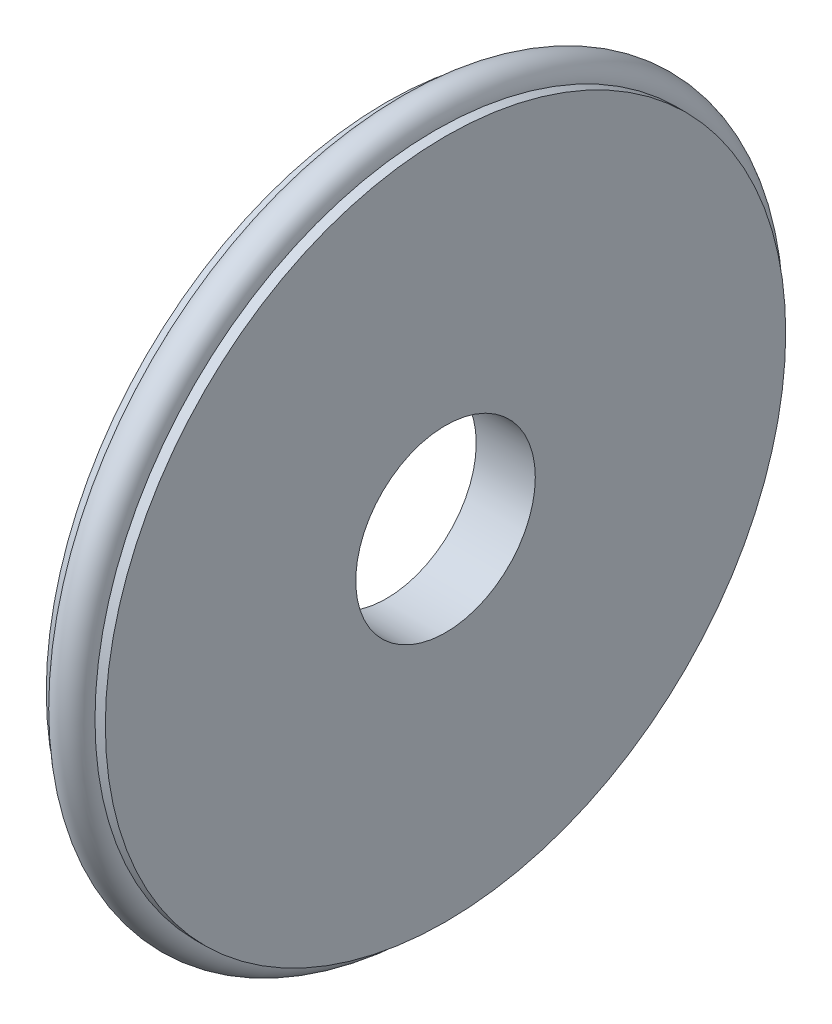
ISO-10303-21;
HEADER;
FILE_DESCRIPTION(('STEP AP214'),'2;1');
FILE_NAME('part.step','',(''),(''),'','','');
FILE_SCHEMA(('AUTOMOTIVE_DESIGN { 1 0 10303 214 1 1 1 1 }'));
ENDSEC;
DATA;
#1=APPLICATION_CONTEXT('core data for automotive mechanical design processes');
#2=APPLICATION_PROTOCOL_DEFINITION('international standard','automotive_design',2000,#1);
#3=PRODUCT_CONTEXT('',#1,'mechanical');
#4=PRODUCT('Part','Part','',(#3));
#5=PRODUCT_RELATED_PRODUCT_CATEGORY('part','',(#4));
#6=PRODUCT_DEFINITION_FORMATION('','',#4);
#7=PRODUCT_DEFINITION_CONTEXT('part definition',#1,'design');
#8=PRODUCT_DEFINITION('design','',#6,#7);
#9=PRODUCT_DEFINITION_SHAPE('','',#8);
#10=(LENGTH_UNIT() NAMED_UNIT(*) SI_UNIT(.MILLI.,.METRE.));
#11=(NAMED_UNIT(*) PLANE_ANGLE_UNIT() SI_UNIT($,.RADIAN.));
#12=(NAMED_UNIT(*) SI_UNIT($,.STERADIAN.) SOLID_ANGLE_UNIT());
#13=UNCERTAINTY_MEASURE_WITH_UNIT(LENGTH_MEASURE(1.E-05),#10,'distance_accuracy_value','');
#14=(GEOMETRIC_REPRESENTATION_CONTEXT(3) GLOBAL_UNCERTAINTY_ASSIGNED_CONTEXT((#13)) GLOBAL_UNIT_ASSIGNED_CONTEXT((#10,
#11,#12)) REPRESENTATION_CONTEXT('',''));
#15=CARTESIAN_POINT('',(0.,0.,0.));
#16=DIRECTION('',(0.,0.,1.));
#17=DIRECTION('',(1.,0.,0.));
#18=AXIS2_PLACEMENT_3D('',#15,#16,#17);
#19=CARTESIAN_POINT('',(-22.9962185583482,0.,0.));
#20=DIRECTION('',(-1.,0.,0.));
#21=DIRECTION('',(0.,-1.,0.));
#22=AXIS2_PLACEMENT_3D('',#19,#20,#21);
#23=CYLINDRICAL_SURFACE('',#22,36.);
#24=CARTESIAN_POINT('',(3.12500000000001,0.,0.));
#25=DIRECTION('',(-1.,0.,0.));
#26=DIRECTION('',(0.,-1.,0.));
#27=AXIS2_PLACEMENT_3D('',#24,#25,#26);
#28=CIRCLE('',#27,36.);
#29=CARTESIAN_POINT('',(3.12500000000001,-36.,0.));
#30=VERTEX_POINT('',#29);
#31=EDGE_CURVE('E45',#30,#30,#28,.T.);
#32=ORIENTED_EDGE('',*,*,#31,.T.);
#33=EDGE_LOOP('',(#32));
#34=FACE_BOUND('',#33,.T.);
#35=CARTESIAN_POINT('',(2.02858739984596,0.,0.));
#36=DIRECTION('',(-1.,0.,0.));
#37=DIRECTION('',(0.,0.,1.));
#38=AXIS2_PLACEMENT_3D('',#35,#36,#37);
#39=CIRCLE('',#38,36.);
#40=CARTESIAN_POINT('',(2.02858739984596,0.,36.));
#41=VERTEX_POINT('',#40);
#42=EDGE_CURVE('E10',#41,#41,#39,.T.);
#43=ORIENTED_EDGE('',*,*,#42,.F.);
#44=EDGE_LOOP('',(#43));
#45=FACE_BOUND('',#44,.T.);
#46=ADVANCED_FACE('F33',(#34,#45),#23,.T.);
#47=CARTESIAN_POINT('',(-22.9962185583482,0.,0.));
#48=DIRECTION('',(-1.,0.,0.));
#49=DIRECTION('',(0.,-1.,0.));
#50=AXIS2_PLACEMENT_3D('',#47,#48,#49);
#51=CYLINDRICAL_SURFACE('',#50,36.);
#52=CARTESIAN_POINT('',(-3.12499999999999,0.,0.));
#53=DIRECTION('',(-1.,0.,0.));
#54=DIRECTION('',(0.,-1.,0.));
#55=AXIS2_PLACEMENT_3D('',#52,#53,#54);
#56=CIRCLE('',#55,36.);
#57=CARTESIAN_POINT('',(-3.12499999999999,-36.,0.));
#58=VERTEX_POINT('',#57);
#59=EDGE_CURVE('E53',#58,#58,#56,.T.);
#60=ORIENTED_EDGE('',*,*,#59,.F.);
#61=EDGE_LOOP('',(#60));
#62=FACE_BOUND('',#61,.T.);
#63=CARTESIAN_POINT('',(-2.02858739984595,0.,0.));
#64=DIRECTION('',(1.,0.,0.));
#65=DIRECTION('',(0.,0.,-1.));
#66=AXIS2_PLACEMENT_3D('',#63,#64,#65);
#67=CIRCLE('',#66,36.);
#68=CARTESIAN_POINT('',(-2.02858739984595,0.,-36.));
#69=VERTEX_POINT('',#68);
#70=EDGE_CURVE('E37',#69,#69,#67,.T.);
#71=ORIENTED_EDGE('',*,*,#70,.F.);
#72=EDGE_LOOP('',(#71));
#73=FACE_BOUND('',#72,.T.);
#74=ADVANCED_FACE('F71',(#62,#73),#51,.T.);
#75=CARTESIAN_POINT('',(-3.125,0.,0.));
#76=DIRECTION('',(1.,0.,0.));
#77=DIRECTION('',(0.,1.,0.));
#78=AXIS2_PLACEMENT_3D('',#75,#76,#77);
#79=PLANE('',#78);
#80=CARTESIAN_POINT('',(-3.12500000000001,0.,0.));
#81=DIRECTION('',(1.,0.,0.));
#82=DIRECTION('',(0.,0.,-1.));
#83=AXIS2_PLACEMENT_3D('',#80,#81,#82);
#84=CIRCLE('',#83,9.5);
#85=CARTESIAN_POINT('',(-3.12500000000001,0.,-9.5));
#86=VERTEX_POINT('',#85);
#87=EDGE_CURVE('E50',#86,#86,#84,.T.);
#88=ORIENTED_EDGE('',*,*,#87,.T.);
#89=EDGE_LOOP('',(#88));
#90=FACE_BOUND('',#89,.T.);
#91=ORIENTED_EDGE('',*,*,#59,.T.);
#92=EDGE_LOOP('',(#91));
#93=FACE_BOUND('',#92,.T.);
#94=ADVANCED_FACE('F35',(#90,#93),#79,.F.);
#95=CARTESIAN_POINT('',(3.125,0.,0.));
#96=DIRECTION('',(-1.,0.,0.));
#97=DIRECTION('',(0.,-1.,0.));
#98=AXIS2_PLACEMENT_3D('',#95,#96,#97);
#99=PLANE('',#98);
#100=CARTESIAN_POINT('',(3.125,0.,0.));
#101=DIRECTION('',(1.,0.,0.));
#102=DIRECTION('',(0.,0.,-1.));
#103=AXIS2_PLACEMENT_3D('',#100,#101,#102);
#104=CIRCLE('',#103,9.5);
#105=CARTESIAN_POINT('',(3.125,0.,-9.5));
#106=VERTEX_POINT('',#105);
#107=EDGE_CURVE('E47',#106,#106,#104,.T.);
#108=ORIENTED_EDGE('',*,*,#107,.F.);
#109=EDGE_LOOP('',(#108));
#110=FACE_BOUND('',#109,.T.);
#111=ORIENTED_EDGE('',*,*,#31,.F.);
#112=EDGE_LOOP('',(#111));
#113=FACE_BOUND('',#112,.T.);
#114=ADVANCED_FACE('F60',(#110,#113),#99,.F.);
#115=CARTESIAN_POINT('',(3.125,0.,0.));
#116=DIRECTION('',(1.,0.,0.));
#117=DIRECTION('',(0.,0.,-1.));
#118=AXIS2_PLACEMENT_3D('',#115,#116,#117);
#119=CYLINDRICAL_SURFACE('',#118,9.5);
#120=ORIENTED_EDGE('',*,*,#87,.F.);
#121=EDGE_LOOP('',(#120));
#122=FACE_BOUND('',#121,.T.);
#123=ORIENTED_EDGE('',*,*,#107,.T.);
#124=EDGE_LOOP('',(#123));
#125=FACE_BOUND('',#124,.T.);
#126=ADVANCED_FACE('F62',(#122,#125),#119,.F.);
#127=CARTESIAN_POINT('',(0.,0.,0.));
#128=DIRECTION('',(-1.,0.,0.));
#129=DIRECTION('',(0.,0.,1.));
#130=AXIS2_PLACEMENT_3D('',#127,#128,#129);
#131=TOROIDAL_SURFACE('',#130,36.,2.02858739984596);
#132=ORIENTED_EDGE('',*,*,#70,.T.);
#133=EDGE_LOOP('',(#132));
#134=FACE_BOUND('',#133,.T.);
#135=ORIENTED_EDGE('',*,*,#42,.T.);
#136=EDGE_LOOP('',(#135));
#137=FACE_BOUND('',#136,.T.);
#138=ADVANCED_FACE('F68',(#134,#137),#131,.T.);
#139=CLOSED_SHELL('',(#46,#74,#94,#114,#126,#138));
#140=MANIFOLD_SOLID_BREP('B2',#139);
#141=ADVANCED_BREP_SHAPE_REPRESENTATION('',(#18,#140),#14);
#142=SHAPE_DEFINITION_REPRESENTATION(#9,#141);
ENDSEC;
END-ISO-10303-21;
